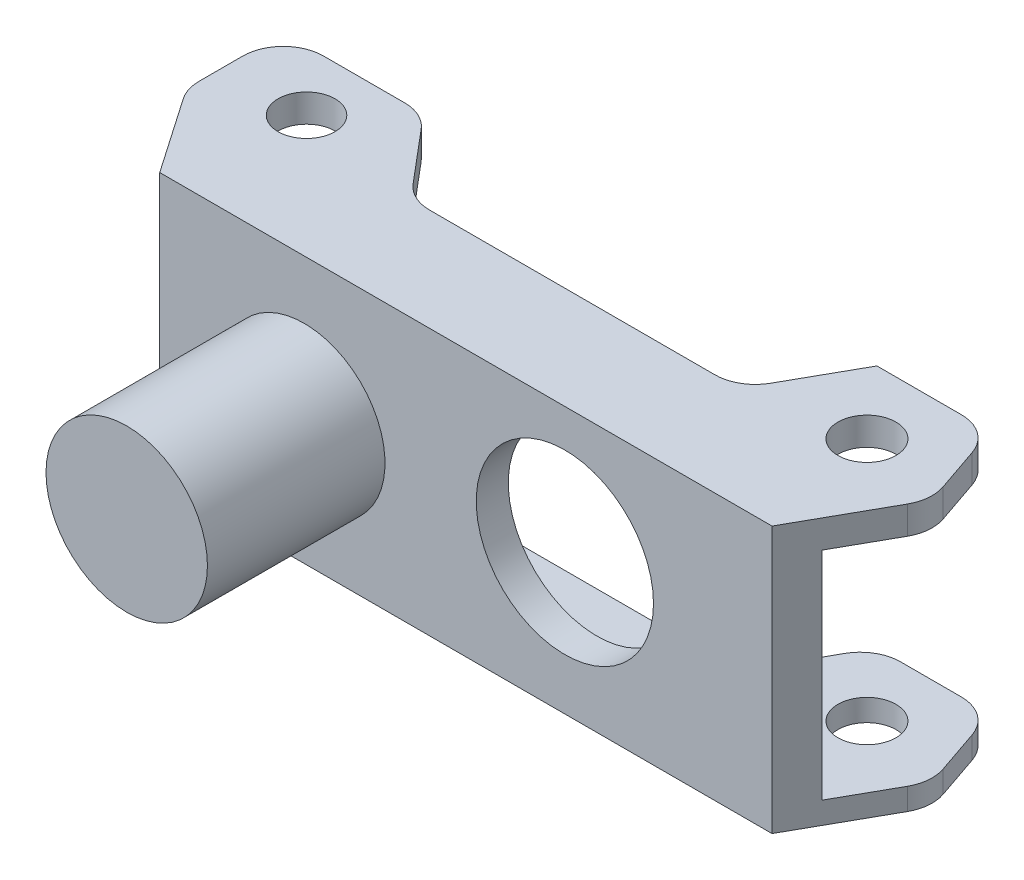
from build123d import *

# Parameters (mm, degrees)
SKETCH1_R          = 10
EXTRUDE1_DEPTH     = 15
EXTRUDE2_START     = 7
SKETCH2_R          = 10
EXTRUDE2_DEPTH     = 7
EXTRUDE5_DEPTH     = 33
SKETCH6_W          = 21.871062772
SKETCH6_H          = 26.824754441
CUT_EXTRUDE1_DEPTH = 101.943790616
SKETCH7_R          = 3.531045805
SKETCH7_R_2        = 3.594142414
CUT_EXTRUDE2_DEPTH = 81.795684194
FILLET6_R          = 5
SKETCH8_R          = 10.980976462
CUT_EXTRUDE3_DEPTH = 79.017105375


with BuildPart() as part:
    # Sketch1 → Extrude1 (new body)
    with BuildSketch(Plane.XY):
        with Locations((2, -17.227058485)):
            Circle(SKETCH1_R)
    extrude(amount=EXTRUDE1_DEPTH)

    # Sketch2 → Extrude2 (add)
    with BuildSketch(Plane(origin=(0, 0, 0), x_dir=(-1, 0, 0), z_dir=(0, 0, -1)).offset(EXTRUDE2_START)):
        with Locations((-2, -17.227058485)):
            Circle(SKETCH2_R)
    extrude(amount=-EXTRUDE2_DEPTH)

    # Sketch5 → Extrude5 (add)
    with BuildSketch(Plane(origin=(0, 0, 0), x_dir=(1, 0, 0), z_dir=(0, 1, 0))):
        Polygon((-15.907949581, 7), (-23.26436451, 17.67616864), (-23.26436451, 29.651727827), (-5.884555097, 29.651727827), (2.510054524, 19.69092733), (43.11444927, 19.69092733), (49.273308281, 30.678204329), (63.301820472, 30.678204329), (67.065567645, 19.69092733), (59.951736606, 7), align=None)
    extrude(amount=-EXTRUDE5_DEPTH)

    # Sketch6 → Cut-Extrude1 (cut, through all)
    with BuildSketch(Plane.ZY.offset(23.26436451)):
        with Locations((-21.908176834, -16.872312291)):
            Rectangle(SKETCH6_W, SKETCH6_H)
    extrude(amount=-CUT_EXTRUDE1_DEPTH, mode=Mode.SUBTRACT)

    # Sketch7 → Cut-Extrude2 (cut, through all)
    with BuildSketch(Plane(origin=(0, 0, 0), x_dir=(-1, 0, 0), z_dir=(0, 1, 0))):
        with Locations(Location((12.963937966, -22.243817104, 0), (0, 0, 90))):
            Circle(SKETCH7_R)
        with Locations(Location((-56.470516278, -22.243817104, 0), (0, 0, 90))):
            Circle(SKETCH7_R_2)
    extrude(amount=-CUT_EXTRUDE2_DEPTH, mode=Mode.SUBTRACT)

    # Fillet6
    fillet6_edges = [part.edges().sort_by_distance(p)[0] for p in [
        (-23.26436451, -31.642344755, -17.67616864),
        (-23.26436451, -31.642344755, -29.651727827),
        (-5.884555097, -31.642344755, -29.651727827),
        (2.510054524, -31.642344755, -19.69092733),
        (43.11444927, -31.642344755, -19.69092733),
        (49.273308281, -31.642344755, -30.678204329),
        (63.301820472, -31.642344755, -30.678204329),
        (67.065567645, -31.642344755, -19.69092733),
        (67.065567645, -1.729967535, -19.69092733),
        (63.301820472, -1.729967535, -30.678204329),
        (43.11444927, -1.729967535, -19.69092733),
        (2.510054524, -1.729967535, -19.69092733),
        (-5.884555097, -1.729967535, -29.651727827),
        (-23.26436451, -1.729967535, -29.651727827),
        (-23.26436451, -1.729967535, -17.67616864),
    ]]
    fillet(fillet6_edges, radius=FILLET6_R)

    # Sketch8 → Cut-Extrude3 (cut, through all)
    with BuildSketch(Plane.XY.offset(-7)):
        with Locations((34.285400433, -15.652526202)):
            Circle(SKETCH8_R)
    extrude(amount=-CUT_EXTRUDE3_DEPTH, mode=Mode.SUBTRACT)


solid = part.part
